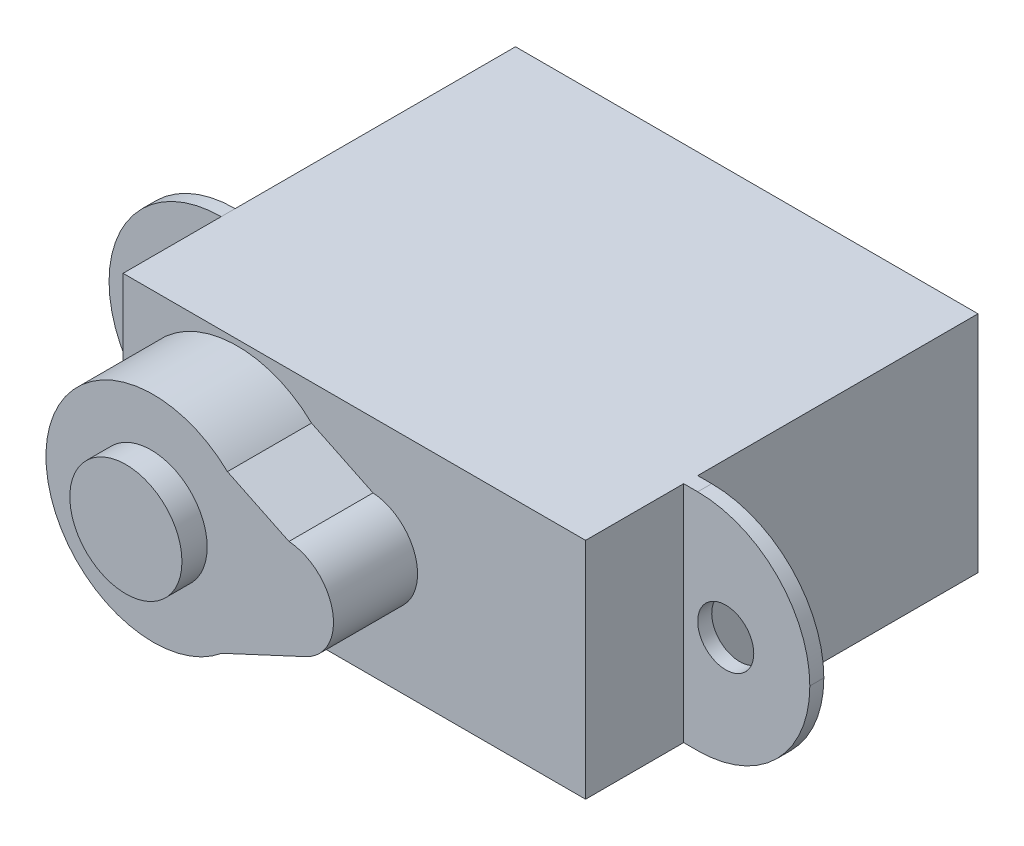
ISO-10303-21;
HEADER;
FILE_DESCRIPTION(('STEP AP214'),'2;1');
FILE_NAME('part.step','',(''),(''),'','','');
FILE_SCHEMA(('AUTOMOTIVE_DESIGN { 1 0 10303 214 1 1 1 1 }'));
ENDSEC;
DATA;
#1=APPLICATION_CONTEXT('core data for automotive mechanical design processes');
#2=APPLICATION_PROTOCOL_DEFINITION('international standard','automotive_design',2000,#1);
#3=PRODUCT_CONTEXT('',#1,'mechanical');
#4=PRODUCT('Part','Part','',(#3));
#5=PRODUCT_RELATED_PRODUCT_CATEGORY('part','',(#4));
#6=PRODUCT_DEFINITION_FORMATION('','',#4);
#7=PRODUCT_DEFINITION_CONTEXT('part definition',#1,'design');
#8=PRODUCT_DEFINITION('design','',#6,#7);
#9=PRODUCT_DEFINITION_SHAPE('','',#8);
#10=(LENGTH_UNIT() NAMED_UNIT(*) SI_UNIT(.MILLI.,.METRE.));
#11=(NAMED_UNIT(*) PLANE_ANGLE_UNIT() SI_UNIT($,.RADIAN.));
#12=(NAMED_UNIT(*) SI_UNIT($,.STERADIAN.) SOLID_ANGLE_UNIT());
#13=UNCERTAINTY_MEASURE_WITH_UNIT(LENGTH_MEASURE(1.E-05),#10,'distance_accuracy_value','');
#14=(GEOMETRIC_REPRESENTATION_CONTEXT(3) GLOBAL_UNCERTAINTY_ASSIGNED_CONTEXT((#13)) GLOBAL_UNIT_ASSIGNED_CONTEXT((#10,
#11,#12)) REPRESENTATION_CONTEXT('',''));
#15=CARTESIAN_POINT('',(0.,0.,0.));
#16=DIRECTION('',(0.,0.,1.));
#17=DIRECTION('',(1.,0.,0.));
#18=AXIS2_PLACEMENT_3D('',#15,#16,#17);
#19=CARTESIAN_POINT('',(-2.61728395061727,1.32778863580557,20.));
#20=DIRECTION('',(0.,0.,-1.));
#21=DIRECTION('',(-1.,0.,0.));
#22=AXIS2_PLACEMENT_3D('',#19,#20,#21);
#23=CYLINDRICAL_SURFACE('',#22,2.);
#24=CARTESIAN_POINT('',(-2.61728395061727,1.32778863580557,17.));
#25=DIRECTION('',(0.,0.,1.));
#26=DIRECTION('',(1.,0.,0.));
#27=AXIS2_PLACEMENT_3D('',#24,#25,#26);
#28=CIRCLE('',#27,2.);
#29=CARTESIAN_POINT('',(-0.61728395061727,1.32778863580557,17.));
#30=VERTEX_POINT('',#29);
#31=EDGE_CURVE('E232',#30,#30,#28,.T.);
#32=ORIENTED_EDGE('',*,*,#31,.T.);
#33=EDGE_LOOP('',(#32));
#34=FACE_BOUND('',#33,.T.);
#35=CARTESIAN_POINT('',(-2.61728395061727,1.32778863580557,17.9));
#36=DIRECTION('',(0.,0.,1.));
#37=DIRECTION('',(1.,0.,0.));
#38=AXIS2_PLACEMENT_3D('',#35,#36,#37);
#39=CIRCLE('',#38,2.);
#40=CARTESIAN_POINT('',(-0.61728395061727,1.32778863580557,17.9));
#41=VERTEX_POINT('',#40);
#42=EDGE_CURVE('E13',#41,#41,#39,.T.);
#43=ORIENTED_EDGE('',*,*,#42,.F.);
#44=EDGE_LOOP('',(#43));
#45=FACE_BOUND('',#44,.T.);
#46=ADVANCED_FACE('F46',(#34,#45),#23,.T.);
#47=CARTESIAN_POINT('',(-6.61728395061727,5.28395061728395,14.));
#48=DIRECTION('',(1.,0.,0.));
#49=DIRECTION('',(0.,0.,-1.));
#50=AXIS2_PLACEMENT_3D('',#47,#48,#49);
#51=PLANE('',#50);
#52=DIRECTION('',(0.,0.,-1.));
#53=VECTOR('',#52,1.);
#54=CARTESIAN_POINT('',(-6.61728395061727,5.28395061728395,14.));
#55=LINE('',#54,#53);
#56=CARTESIAN_POINT('',(-6.61728395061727,5.28395061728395,14.));
#57=VERTEX_POINT('',#56);
#58=CARTESIAN_POINT('',(-6.61728395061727,5.28395061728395,10.5));
#59=VERTEX_POINT('',#58);
#60=EDGE_CURVE('E229',#57,#59,#55,.T.);
#61=ORIENTED_EDGE('',*,*,#60,.T.);
#62=DIRECTION('',(0.,-1.,0.));
#63=VECTOR('',#62,1.);
#64=CARTESIAN_POINT('',(-6.61728395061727,5.28395061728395,10.5));
#65=LINE('',#64,#63);
#66=CARTESIAN_POINT('',(-6.61728395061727,-2.71604938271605,10.5));
#67=VERTEX_POINT('',#66);
#68=EDGE_CURVE('E223',#59,#67,#65,.T.);
#69=ORIENTED_EDGE('',*,*,#68,.T.);
#70=DIRECTION('',(0.,0.,-1.));
#71=VECTOR('',#70,1.);
#72=CARTESIAN_POINT('',(-6.61728395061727,-2.71604938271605,14.));
#73=LINE('',#72,#71);
#74=CARTESIAN_POINT('',(-6.61728395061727,-2.71604938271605,14.));
#75=VERTEX_POINT('',#74);
#76=EDGE_CURVE('E172',#75,#67,#73,.T.);
#77=ORIENTED_EDGE('',*,*,#76,.F.);
#78=DIRECTION('',(0.,-1.,0.));
#79=VECTOR('',#78,1.);
#80=CARTESIAN_POINT('',(-6.61728395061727,5.28395061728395,14.));
#81=LINE('',#80,#79);
#82=EDGE_CURVE('E227',#57,#75,#81,.T.);
#83=ORIENTED_EDGE('',*,*,#82,.F.);
#84=EDGE_LOOP('',(#61,#69,#77,#83));
#85=FACE_BOUND('',#84,.T.);
#86=ADVANCED_FACE('F346',(#85),#51,.F.);
#87=CARTESIAN_POINT('',(9.88271604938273,5.28395061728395,14.));
#88=DIRECTION('',(-1.,0.,0.));
#89=DIRECTION('',(0.,0.,1.));
#90=AXIS2_PLACEMENT_3D('',#87,#88,#89);
#91=PLANE('',#90);
#92=DIRECTION('',(0.,0.,-1.));
#93=VECTOR('',#92,1.);
#94=CARTESIAN_POINT('',(9.88271604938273,-2.71604938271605,14.));
#95=LINE('',#94,#93);
#96=CARTESIAN_POINT('',(9.88271604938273,-2.71604938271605,14.));
#97=VERTEX_POINT('',#96);
#98=CARTESIAN_POINT('',(9.88271604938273,-2.71604938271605,10.5));
#99=VERTEX_POINT('',#98);
#100=EDGE_CURVE('E220',#97,#99,#95,.T.);
#101=ORIENTED_EDGE('',*,*,#100,.T.);
#102=DIRECTION('',(0.,1.,0.));
#103=VECTOR('',#102,1.);
#104=CARTESIAN_POINT('',(9.88271604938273,5.28395061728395,10.5));
#105=LINE('',#104,#103);
#106=CARTESIAN_POINT('',(9.88271604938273,5.28395061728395,10.5));
#107=VERTEX_POINT('',#106);
#108=EDGE_CURVE('E187',#99,#107,#105,.T.);
#109=ORIENTED_EDGE('',*,*,#108,.T.);
#110=DIRECTION('',(0.,0.,-1.));
#111=VECTOR('',#110,1.);
#112=CARTESIAN_POINT('',(9.88271604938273,5.28395061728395,14.));
#113=LINE('',#112,#111);
#114=CARTESIAN_POINT('',(9.88271604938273,5.28395061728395,14.));
#115=VERTEX_POINT('',#114);
#116=EDGE_CURVE('E217',#115,#107,#113,.T.);
#117=ORIENTED_EDGE('',*,*,#116,.F.);
#118=DIRECTION('',(0.,1.,0.));
#119=VECTOR('',#118,1.);
#120=CARTESIAN_POINT('',(9.88271604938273,5.28395061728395,14.));
#121=LINE('',#120,#119);
#122=EDGE_CURVE('E243',#97,#115,#121,.T.);
#123=ORIENTED_EDGE('',*,*,#122,.F.);
#124=EDGE_LOOP('',(#101,#109,#117,#123));
#125=FACE_BOUND('',#124,.T.);
#126=ADVANCED_FACE('F339',(#125),#91,.F.);
#127=CARTESIAN_POINT('',(-6.61728395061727,-2.71604938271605,10.));
#128=VERTEX_POINT('',#127);
#129=CARTESIAN_POINT('',(-6.61728395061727,-2.71604938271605,0.));
#130=VERTEX_POINT('',#129);
#131=EDGE_CURVE('E169',#128,#130,#73,.T.);
#132=ORIENTED_EDGE('',*,*,#131,.F.);
#133=DIRECTION('',(0.,1.,0.));
#134=VECTOR('',#133,1.);
#135=CARTESIAN_POINT('',(-6.61728395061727,5.28395061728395,10.));
#136=LINE('',#135,#134);
#137=CARTESIAN_POINT('',(-6.61728395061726,5.28395061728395,10.));
#138=VERTEX_POINT('',#137);
#139=EDGE_CURVE('E180',#128,#138,#136,.T.);
#140=ORIENTED_EDGE('',*,*,#139,.T.);
#141=CARTESIAN_POINT('',(-6.61728395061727,5.28395061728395,0.));
#142=VERTEX_POINT('',#141);
#143=EDGE_CURVE('E186',#138,#142,#55,.T.);
#144=ORIENTED_EDGE('',*,*,#143,.T.);
#145=DIRECTION('',(0.,-1.,0.));
#146=VECTOR('',#145,1.);
#147=CARTESIAN_POINT('',(-6.61728395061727,5.28395061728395,0.));
#148=LINE('',#147,#146);
#149=EDGE_CURVE('E182',#142,#130,#148,.T.);
#150=ORIENTED_EDGE('',*,*,#149,.T.);
#151=EDGE_LOOP('',(#132,#140,#144,#150));
#152=FACE_BOUND('',#151,.T.);
#153=ADVANCED_FACE('F179',(#152),#51,.F.);
#154=CARTESIAN_POINT('',(-6.61728395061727,-2.71604938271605,14.));
#155=DIRECTION('',(0.,1.,0.));
#156=DIRECTION('',(0.,0.,1.));
#157=AXIS2_PLACEMENT_3D('',#154,#155,#156);
#158=PLANE('',#157);
#159=DIRECTION('',(-1.,0.,0.));
#160=VECTOR('',#159,1.);
#161=CARTESIAN_POINT('',(14.3827160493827,-2.71604938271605,10.));
#162=LINE('',#161,#160);
#163=CARTESIAN_POINT('',(10.3827160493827,-2.71604938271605,10.));
#164=VERTEX_POINT('',#163);
#165=CARTESIAN_POINT('',(9.88271604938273,-2.71604938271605,10.));
#166=VERTEX_POINT('',#165);
#167=EDGE_CURVE('E205',#164,#166,#162,.T.);
#168=ORIENTED_EDGE('',*,*,#167,.F.);
#169=DIRECTION('',(0.,0.,1.));
#170=VECTOR('',#169,1.);
#171=CARTESIAN_POINT('',(10.3827160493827,-2.71604938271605,10.5));
#172=LINE('',#171,#170);
#173=CARTESIAN_POINT('',(10.3827160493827,-2.71604938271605,10.5));
#174=VERTEX_POINT('',#173);
#175=EDGE_CURVE('E197',#164,#174,#172,.T.);
#176=ORIENTED_EDGE('',*,*,#175,.T.);
#177=DIRECTION('',(-1.,0.,0.));
#178=VECTOR('',#177,1.);
#179=CARTESIAN_POINT('',(14.3827160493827,-2.71604938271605,10.5));
#180=LINE('',#179,#178);
#181=EDGE_CURVE('E198',#174,#99,#180,.T.);
#182=ORIENTED_EDGE('',*,*,#181,.T.);
#183=ORIENTED_EDGE('',*,*,#100,.F.);
#184=DIRECTION('',(1.,0.,0.));
#185=VECTOR('',#184,1.);
#186=CARTESIAN_POINT('',(-6.61728395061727,-2.71604938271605,14.));
#187=LINE('',#186,#185);
#188=EDGE_CURVE('E245',#75,#97,#187,.T.);
#189=ORIENTED_EDGE('',*,*,#188,.F.);
#190=ORIENTED_EDGE('',*,*,#76,.T.);
#191=DIRECTION('',(0.,0.,1.));
#192=VECTOR('',#191,1.);
#193=CARTESIAN_POINT('',(-6.61728395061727,-2.71604938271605,14.));
#194=LINE('',#193,#192);
#195=EDGE_CURVE('E164',#67,#128,#194,.F.);
#196=ORIENTED_EDGE('',*,*,#195,.T.);
#197=ORIENTED_EDGE('',*,*,#131,.T.);
#198=DIRECTION('',(1.,0.,0.));
#199=VECTOR('',#198,1.);
#200=CARTESIAN_POINT('',(-6.61728395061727,-2.71604938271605,0.));
#201=LINE('',#200,#199);
#202=CARTESIAN_POINT('',(9.88271604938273,-2.71604938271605,0.));
#203=VERTEX_POINT('',#202);
#204=EDGE_CURVE('E183',#130,#203,#201,.T.);
#205=ORIENTED_EDGE('',*,*,#204,.T.);
#206=EDGE_CURVE('E224',#166,#203,#95,.T.);
#207=ORIENTED_EDGE('',*,*,#206,.F.);
#208=EDGE_LOOP('',(#168,#176,#182,#183,#189,#190,#196,#197,#205,#207));
#209=FACE_BOUND('',#208,.T.);
#210=ADVANCED_FACE('F167',(#209),#158,.F.);
#211=CARTESIAN_POINT('',(9.88271604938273,5.28395061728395,10.));
#212=VERTEX_POINT('',#211);
#213=CARTESIAN_POINT('',(9.88271604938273,5.28395061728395,0.));
#214=VERTEX_POINT('',#213);
#215=EDGE_CURVE('E228',#212,#214,#113,.T.);
#216=ORIENTED_EDGE('',*,*,#215,.F.);
#217=DIRECTION('',(0.,-1.,0.));
#218=VECTOR('',#217,1.);
#219=CARTESIAN_POINT('',(9.88271604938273,5.28395061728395,10.));
#220=LINE('',#219,#218);
#221=EDGE_CURVE('E238',#212,#166,#220,.T.);
#222=ORIENTED_EDGE('',*,*,#221,.T.);
#223=ORIENTED_EDGE('',*,*,#206,.T.);
#224=DIRECTION('',(0.,1.,0.));
#225=VECTOR('',#224,1.);
#226=CARTESIAN_POINT('',(9.88271604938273,5.28395061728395,0.));
#227=LINE('',#226,#225);
#228=EDGE_CURVE('E215',#203,#214,#227,.T.);
#229=ORIENTED_EDGE('',*,*,#228,.T.);
#230=EDGE_LOOP('',(#216,#222,#223,#229));
#231=FACE_BOUND('',#230,.T.);
#232=ADVANCED_FACE('F330',(#231),#91,.F.);
#233=CARTESIAN_POINT('',(-6.61728395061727,5.28395061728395,14.));
#234=DIRECTION('',(0.,-1.,0.));
#235=DIRECTION('',(0.,0.,-1.));
#236=AXIS2_PLACEMENT_3D('',#233,#234,#235);
#237=PLANE('',#236);
#238=DIRECTION('',(-1.,0.,0.));
#239=VECTOR('',#238,1.);
#240=CARTESIAN_POINT('',(14.3827160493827,5.28395061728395,10.5));
#241=LINE('',#240,#239);
#242=CARTESIAN_POINT('',(10.3827160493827,5.28395061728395,10.5));
#243=VERTEX_POINT('',#242);
#244=EDGE_CURVE('E202',#243,#107,#241,.T.);
#245=ORIENTED_EDGE('',*,*,#244,.F.);
#246=DIRECTION('',(0.,0.,-1.));
#247=VECTOR('',#246,1.);
#248=CARTESIAN_POINT('',(10.3827160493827,5.28395061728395,10.));
#249=LINE('',#248,#247);
#250=CARTESIAN_POINT('',(10.3827160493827,5.28395061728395,10.));
#251=VERTEX_POINT('',#250);
#252=EDGE_CURVE('E211',#243,#251,#249,.T.);
#253=ORIENTED_EDGE('',*,*,#252,.T.);
#254=DIRECTION('',(-1.,0.,0.));
#255=VECTOR('',#254,1.);
#256=CARTESIAN_POINT('',(14.3827160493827,5.28395061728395,10.));
#257=LINE('',#256,#255);
#258=EDGE_CURVE('E214',#251,#212,#257,.T.);
#259=ORIENTED_EDGE('',*,*,#258,.T.);
#260=ORIENTED_EDGE('',*,*,#215,.T.);
#261=DIRECTION('',(-1.,0.,0.));
#262=VECTOR('',#261,1.);
#263=CARTESIAN_POINT('',(-6.61728395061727,5.28395061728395,0.));
#264=LINE('',#263,#262);
#265=EDGE_CURVE('E218',#214,#142,#264,.T.);
#266=ORIENTED_EDGE('',*,*,#265,.T.);
#267=ORIENTED_EDGE('',*,*,#143,.F.);
#268=DIRECTION('',(0.,0.,-1.));
#269=VECTOR('',#268,1.);
#270=CARTESIAN_POINT('',(-6.61728395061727,5.28395061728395,14.));
#271=LINE('',#270,#269);
#272=EDGE_CURVE('E216',#138,#59,#271,.F.);
#273=ORIENTED_EDGE('',*,*,#272,.T.);
#274=ORIENTED_EDGE('',*,*,#60,.F.);
#275=DIRECTION('',(-1.,0.,0.));
#276=VECTOR('',#275,1.);
#277=CARTESIAN_POINT('',(-6.61728395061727,5.28395061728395,14.));
#278=LINE('',#277,#276);
#279=EDGE_CURVE('E240',#115,#57,#278,.T.);
#280=ORIENTED_EDGE('',*,*,#279,.F.);
#281=ORIENTED_EDGE('',*,*,#116,.T.);
#282=EDGE_LOOP('',(#245,#253,#259,#260,#266,#267,#273,#274,#280,#281));
#283=FACE_BOUND('',#282,.T.);
#284=ADVANCED_FACE('F324',(#283),#237,.F.);
#285=CARTESIAN_POINT('',(0.,0.,14.));
#286=DIRECTION('',(0.,0.,1.));
#287=DIRECTION('',(1.,0.,0.));
#288=AXIS2_PLACEMENT_3D('',#285,#286,#287);
#289=PLANE('',#288);
#290=CARTESIAN_POINT('',(-2.54066331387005,1.25043792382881,14.));
#291=DIRECTION('',(0.,0.,1.));
#292=DIRECTION('',(1.,0.,0.));
#293=AXIS2_PLACEMENT_3D('',#290,#291,#292);
#294=CIRCLE('',#293,3.82870321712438);
#295=CARTESIAN_POINT('',(0.105430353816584,4.01759470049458,14.));
#296=VERTEX_POINT('',#295);
#297=CARTESIAN_POINT('',(-0.0946737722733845,-1.69508469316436,14.));
#298=VERTEX_POINT('',#297);
#299=EDGE_CURVE('E242',#296,#298,#294,.T.);
#300=ORIENTED_EDGE('',*,*,#299,.F.);
#301=DIRECTION('',(-0.900694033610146,0.434453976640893,0.));
#302=VECTOR('',#301,1.);
#303=CARTESIAN_POINT('',(0.105430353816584,4.01759470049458,14.));
#304=LINE('',#303,#302);
#305=CARTESIAN_POINT('',(2.30086226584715,2.95861785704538,14.));
#306=VERTEX_POINT('',#305);
#307=EDGE_CURVE('E257',#306,#296,#304,.T.);
#308=ORIENTED_EDGE('',*,*,#307,.F.);
#309=CARTESIAN_POINT('',(2.17630747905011,1.25043792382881,14.));
#310=DIRECTION('',(0.,0.,1.));
#311=DIRECTION('',(1.,0.,0.));
#312=AXIS2_PLACEMENT_3D('',#309,#310,#311);
#313=CIRCLE('',#312,1.71271497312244);
#314=CARTESIAN_POINT('',(2.89875783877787,-0.302449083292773,14.));
#315=VERTEX_POINT('',#314);
#316=EDGE_CURVE('E252',#315,#306,#313,.T.);
#317=ORIENTED_EDGE('',*,*,#316,.F.);
#318=DIRECTION('',(0.906681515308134,0.421815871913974,0.));
#319=VECTOR('',#318,1.);
#320=CARTESIAN_POINT('',(2.89875783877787,-0.302449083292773,14.));
#321=LINE('',#320,#319);
#322=EDGE_CURVE('E253',#298,#315,#321,.T.);
#323=ORIENTED_EDGE('',*,*,#322,.F.);
#324=EDGE_LOOP('',(#300,#308,#317,#323));
#325=FACE_BOUND('',#324,.T.);
#326=ORIENTED_EDGE('',*,*,#82,.T.);
#327=ORIENTED_EDGE('',*,*,#188,.T.);
#328=ORIENTED_EDGE('',*,*,#122,.T.);
#329=ORIENTED_EDGE('',*,*,#279,.T.);
#330=EDGE_LOOP('',(#326,#327,#328,#329));
#331=FACE_BOUND('',#330,.T.);
#332=ADVANCED_FACE('F342',(#325,#331),#289,.T.);
#333=CARTESIAN_POINT('',(0.,0.,0.));
#334=DIRECTION('',(0.,0.,1.));
#335=DIRECTION('',(1.,0.,0.));
#336=AXIS2_PLACEMENT_3D('',#333,#334,#335);
#337=PLANE('',#336);
#338=ORIENTED_EDGE('',*,*,#149,.F.);
#339=ORIENTED_EDGE('',*,*,#265,.F.);
#340=ORIENTED_EDGE('',*,*,#228,.F.);
#341=ORIENTED_EDGE('',*,*,#204,.F.);
#342=EDGE_LOOP('',(#338,#339,#340,#341));
#343=FACE_BOUND('',#342,.T.);
#344=ADVANCED_FACE('F334',(#343),#337,.F.);
#345=CARTESIAN_POINT('',(-2.54066331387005,1.25043792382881,17.));
#346=DIRECTION('',(0.,0.,-1.));
#347=DIRECTION('',(-1.,0.,0.));
#348=AXIS2_PLACEMENT_3D('',#345,#346,#347);
#349=CYLINDRICAL_SURFACE('',#348,3.82870321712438);
#350=ORIENTED_EDGE('',*,*,#299,.T.);
#351=DIRECTION('',(0.,0.,-1.));
#352=VECTOR('',#351,1.);
#353=CARTESIAN_POINT('',(-0.0946737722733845,-1.69508469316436,17.));
#354=LINE('',#353,#352);
#355=CARTESIAN_POINT('',(-0.0946737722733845,-1.69508469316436,17.));
#356=VERTEX_POINT('',#355);
#357=EDGE_CURVE('E249',#356,#298,#354,.T.);
#358=ORIENTED_EDGE('',*,*,#357,.F.);
#359=CARTESIAN_POINT('',(-2.54066331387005,1.25043792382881,17.));
#360=DIRECTION('',(0.,0.,1.));
#361=DIRECTION('',(1.,0.,0.));
#362=AXIS2_PLACEMENT_3D('',#359,#360,#361);
#363=CIRCLE('',#362,3.82870321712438);
#364=CARTESIAN_POINT('',(0.105430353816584,4.01759470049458,17.));
#365=VERTEX_POINT('',#364);
#366=EDGE_CURVE('E261',#365,#356,#363,.T.);
#367=ORIENTED_EDGE('',*,*,#366,.F.);
#368=DIRECTION('',(0.,0.,-1.));
#369=VECTOR('',#368,1.);
#370=CARTESIAN_POINT('',(0.105430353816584,4.01759470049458,17.));
#371=LINE('',#370,#369);
#372=EDGE_CURVE('E262',#365,#296,#371,.T.);
#373=ORIENTED_EDGE('',*,*,#372,.T.);
#374=EDGE_LOOP('',(#350,#358,#367,#373));
#375=FACE_BOUND('',#374,.T.);
#376=ADVANCED_FACE('F392',(#375),#349,.T.);
#377=CARTESIAN_POINT('',(2.89875783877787,-0.302449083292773,17.));
#378=DIRECTION('',(-0.421815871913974,0.906681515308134,0.));
#379=DIRECTION('',(-0.906681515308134,-0.421815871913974,0.));
#380=AXIS2_PLACEMENT_3D('',#377,#378,#379);
#381=PLANE('',#380);
#382=ORIENTED_EDGE('',*,*,#322,.T.);
#383=DIRECTION('',(0.,0.,-1.));
#384=VECTOR('',#383,1.);
#385=CARTESIAN_POINT('',(2.89875783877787,-0.302449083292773,17.));
#386=LINE('',#385,#384);
#387=CARTESIAN_POINT('',(2.89875783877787,-0.302449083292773,17.));
#388=VERTEX_POINT('',#387);
#389=EDGE_CURVE('E254',#388,#315,#386,.T.);
#390=ORIENTED_EDGE('',*,*,#389,.F.);
#391=DIRECTION('',(0.906681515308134,0.421815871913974,0.));
#392=VECTOR('',#391,1.);
#393=CARTESIAN_POINT('',(2.89875783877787,-0.302449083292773,17.));
#394=LINE('',#393,#392);
#395=EDGE_CURVE('E276',#356,#388,#394,.T.);
#396=ORIENTED_EDGE('',*,*,#395,.F.);
#397=ORIENTED_EDGE('',*,*,#357,.T.);
#398=EDGE_LOOP('',(#382,#390,#396,#397));
#399=FACE_BOUND('',#398,.T.);
#400=ADVANCED_FACE('F388',(#399),#381,.F.);
#401=CARTESIAN_POINT('',(2.17630747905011,1.25043792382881,17.));
#402=DIRECTION('',(0.,0.,-1.));
#403=DIRECTION('',(-1.,0.,0.));
#404=AXIS2_PLACEMENT_3D('',#401,#402,#403);
#405=CYLINDRICAL_SURFACE('',#404,1.71271497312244);
#406=ORIENTED_EDGE('',*,*,#316,.T.);
#407=DIRECTION('',(0.,0.,-1.));
#408=VECTOR('',#407,1.);
#409=CARTESIAN_POINT('',(2.30086226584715,2.95861785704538,17.));
#410=LINE('',#409,#408);
#411=CARTESIAN_POINT('',(2.30086226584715,2.95861785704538,17.));
#412=VERTEX_POINT('',#411);
#413=EDGE_CURVE('E258',#412,#306,#410,.T.);
#414=ORIENTED_EDGE('',*,*,#413,.F.);
#415=CARTESIAN_POINT('',(2.17630747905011,1.25043792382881,17.));
#416=DIRECTION('',(0.,0.,1.));
#417=DIRECTION('',(1.,0.,0.));
#418=AXIS2_PLACEMENT_3D('',#415,#416,#417);
#419=CIRCLE('',#418,1.71271497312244);
#420=EDGE_CURVE('E274',#388,#412,#419,.T.);
#421=ORIENTED_EDGE('',*,*,#420,.F.);
#422=ORIENTED_EDGE('',*,*,#389,.T.);
#423=EDGE_LOOP('',(#406,#414,#421,#422));
#424=FACE_BOUND('',#423,.T.);
#425=ADVANCED_FACE('F384',(#424),#405,.T.);
#426=CARTESIAN_POINT('',(0.105430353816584,4.01759470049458,17.));
#427=DIRECTION('',(-0.434453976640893,-0.900694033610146,0.));
#428=DIRECTION('',(0.900694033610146,-0.434453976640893,0.));
#429=AXIS2_PLACEMENT_3D('',#426,#427,#428);
#430=PLANE('',#429);
#431=ORIENTED_EDGE('',*,*,#307,.T.);
#432=ORIENTED_EDGE('',*,*,#372,.F.);
#433=DIRECTION('',(-0.900694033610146,0.434453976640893,0.));
#434=VECTOR('',#433,1.);
#435=CARTESIAN_POINT('',(0.105430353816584,4.01759470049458,17.));
#436=LINE('',#435,#434);
#437=EDGE_CURVE('E209',#412,#365,#436,.T.);
#438=ORIENTED_EDGE('',*,*,#437,.F.);
#439=ORIENTED_EDGE('',*,*,#413,.T.);
#440=EDGE_LOOP('',(#431,#432,#438,#439));
#441=FACE_BOUND('',#440,.T.);
#442=ADVANCED_FACE('F380',(#441),#430,.F.);
#443=CARTESIAN_POINT('',(-2.54066331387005,1.25043792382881,17.));
#444=DIRECTION('',(0.,0.,1.));
#445=DIRECTION('',(1.,0.,0.));
#446=AXIS2_PLACEMENT_3D('',#443,#444,#445);
#447=PLANE('',#446);
#448=ORIENTED_EDGE('',*,*,#31,.F.);
#449=EDGE_LOOP('',(#448));
#450=FACE_BOUND('',#449,.T.);
#451=ORIENTED_EDGE('',*,*,#366,.T.);
#452=ORIENTED_EDGE('',*,*,#395,.T.);
#453=ORIENTED_EDGE('',*,*,#420,.T.);
#454=ORIENTED_EDGE('',*,*,#437,.T.);
#455=EDGE_LOOP('',(#451,#452,#453,#454));
#456=FACE_BOUND('',#455,.T.);
#457=ADVANCED_FACE('F377',(#450,#456),#447,.T.);
#458=CARTESIAN_POINT('',(14.3827160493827,5.28395061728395,10.));
#459=DIRECTION('',(0.,0.,-1.));
#460=DIRECTION('',(0.,1.,0.));
#461=AXIS2_PLACEMENT_3D('',#458,#459,#460);
#462=PLANE('',#461);
#463=CARTESIAN_POINT('',(11.3827160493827,1.28395061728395,10.));
#464=DIRECTION('',(0.,0.,-1.));
#465=DIRECTION('',(0.,1.,0.));
#466=AXIS2_PLACEMENT_3D('',#463,#464,#465);
#467=CIRCLE('',#466,1.);
#468=CARTESIAN_POINT('',(11.3827160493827,2.28395061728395,10.));
#469=VERTEX_POINT('',#468);
#470=EDGE_CURVE('E294',#469,#469,#467,.T.);
#471=ORIENTED_EDGE('',*,*,#470,.F.);
#472=EDGE_LOOP('',(#471));
#473=FACE_BOUND('',#472,.T.);
#474=ORIENTED_EDGE('',*,*,#258,.F.);
#475=CARTESIAN_POINT('',(10.3827160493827,1.28395061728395,10.));
#476=DIRECTION('',(0.,0.,-1.));
#477=DIRECTION('',(0.,1.,0.));
#478=AXIS2_PLACEMENT_3D('',#475,#476,#477);
#479=CIRCLE('',#478,4.);
#480=CARTESIAN_POINT('',(14.3827160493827,1.28395061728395,10.));
#481=VERTEX_POINT('',#480);
#482=EDGE_CURVE('E206',#251,#481,#479,.T.);
#483=ORIENTED_EDGE('',*,*,#482,.T.);
#484=CARTESIAN_POINT('',(10.3827160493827,1.28395061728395,10.));
#485=DIRECTION('',(0.,0.,-1.));
#486=DIRECTION('',(0.,1.,0.));
#487=AXIS2_PLACEMENT_3D('',#484,#485,#486);
#488=CIRCLE('',#487,4.);
#489=EDGE_CURVE('E208',#481,#164,#488,.T.);
#490=ORIENTED_EDGE('',*,*,#489,.T.);
#491=ORIENTED_EDGE('',*,*,#167,.T.);
#492=ORIENTED_EDGE('',*,*,#221,.F.);
#493=EDGE_LOOP('',(#474,#483,#490,#491,#492));
#494=FACE_BOUND('',#493,.T.);
#495=ADVANCED_FACE('F305',(#473,#494),#462,.T.);
#496=CARTESIAN_POINT('',(14.3827160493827,5.28395061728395,10.5));
#497=DIRECTION('',(0.,0.,1.));
#498=DIRECTION('',(0.,-1.,0.));
#499=AXIS2_PLACEMENT_3D('',#496,#497,#498);
#500=PLANE('',#499);
#501=CARTESIAN_POINT('',(11.3827160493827,1.28395061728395,10.5));
#502=DIRECTION('',(0.,0.,1.));
#503=DIRECTION('',(1.,0.,0.));
#504=AXIS2_PLACEMENT_3D('',#501,#502,#503);
#505=CIRCLE('',#504,1.);
#506=CARTESIAN_POINT('',(12.3827160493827,1.28395061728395,10.5));
#507=VERTEX_POINT('',#506);
#508=EDGE_CURVE('E56',#507,#507,#505,.T.);
#509=ORIENTED_EDGE('',*,*,#508,.F.);
#510=EDGE_LOOP('',(#509));
#511=FACE_BOUND('',#510,.T.);
#512=CARTESIAN_POINT('',(10.3827160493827,1.28395061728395,10.5));
#513=DIRECTION('',(0.,0.,1.));
#514=DIRECTION('',(0.,-1.,0.));
#515=AXIS2_PLACEMENT_3D('',#512,#513,#514);
#516=CIRCLE('',#515,4.);
#517=CARTESIAN_POINT('',(14.3827160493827,1.28395061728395,10.5));
#518=VERTEX_POINT('',#517);
#519=EDGE_CURVE('E203',#174,#518,#516,.T.);
#520=ORIENTED_EDGE('',*,*,#519,.T.);
#521=CARTESIAN_POINT('',(10.3827160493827,1.28395061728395,10.5));
#522=DIRECTION('',(0.,0.,1.));
#523=DIRECTION('',(0.,-1.,0.));
#524=AXIS2_PLACEMENT_3D('',#521,#522,#523);
#525=CIRCLE('',#524,4.);
#526=EDGE_CURVE('E200',#518,#243,#525,.T.);
#527=ORIENTED_EDGE('',*,*,#526,.T.);
#528=ORIENTED_EDGE('',*,*,#244,.T.);
#529=ORIENTED_EDGE('',*,*,#108,.F.);
#530=ORIENTED_EDGE('',*,*,#181,.F.);
#531=EDGE_LOOP('',(#520,#527,#528,#529,#530));
#532=FACE_BOUND('',#531,.T.);
#533=ADVANCED_FACE('F301',(#511,#532),#500,.T.);
#534=CARTESIAN_POINT('',(-8.11728395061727,1.28395061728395,10.5));
#535=DIRECTION('',(0.,0.,1.));
#536=DIRECTION('',(1.,0.,0.));
#537=AXIS2_PLACEMENT_3D('',#534,#535,#536);
#538=CIRCLE('',#537,1.);
#539=CARTESIAN_POINT('',(-7.11728395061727,1.28395061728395,10.5));
#540=VERTEX_POINT('',#539);
#541=EDGE_CURVE('E50',#540,#540,#538,.T.);
#542=ORIENTED_EDGE('',*,*,#541,.F.);
#543=EDGE_LOOP('',(#542));
#544=FACE_BOUND('',#543,.T.);
#545=ORIENTED_EDGE('',*,*,#68,.F.);
#546=CARTESIAN_POINT('',(-6.61728395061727,1.28395061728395,10.5));
#547=DIRECTION('',(0.,0.,1.));
#548=DIRECTION('',(0.,-1.,0.));
#549=AXIS2_PLACEMENT_3D('',#546,#547,#548);
#550=CIRCLE('',#549,4.);
#551=CARTESIAN_POINT('',(-10.6172839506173,1.28395061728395,10.5));
#552=VERTEX_POINT('',#551);
#553=EDGE_CURVE('E65',#59,#552,#550,.T.);
#554=ORIENTED_EDGE('',*,*,#553,.T.);
#555=CARTESIAN_POINT('',(-6.61728395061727,1.28395061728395,10.5));
#556=DIRECTION('',(0.,0.,1.));
#557=DIRECTION('',(0.,-1.,0.));
#558=AXIS2_PLACEMENT_3D('',#555,#556,#557);
#559=CIRCLE('',#558,4.);
#560=EDGE_CURVE('E191',#552,#67,#559,.T.);
#561=ORIENTED_EDGE('',*,*,#560,.T.);
#562=EDGE_LOOP('',(#545,#554,#561));
#563=FACE_BOUND('',#562,.T.);
#564=ADVANCED_FACE('F304',(#544,#563),#500,.T.);
#565=CARTESIAN_POINT('',(-8.11728395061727,1.28395061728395,10.));
#566=DIRECTION('',(0.,0.,-1.));
#567=DIRECTION('',(0.,1.,0.));
#568=AXIS2_PLACEMENT_3D('',#565,#566,#567);
#569=CIRCLE('',#568,1.);
#570=CARTESIAN_POINT('',(-8.11728395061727,2.28395061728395,10.));
#571=VERTEX_POINT('',#570);
#572=EDGE_CURVE('E350',#571,#571,#569,.T.);
#573=ORIENTED_EDGE('',*,*,#572,.F.);
#574=EDGE_LOOP('',(#573));
#575=FACE_BOUND('',#574,.T.);
#576=CARTESIAN_POINT('',(-6.61728395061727,1.28395061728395,10.));
#577=DIRECTION('',(0.,0.,-1.));
#578=DIRECTION('',(0.,1.,0.));
#579=AXIS2_PLACEMENT_3D('',#576,#577,#578);
#580=CIRCLE('',#579,4.);
#581=CARTESIAN_POINT('',(-10.6172839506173,1.28395061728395,10.));
#582=VERTEX_POINT('',#581);
#583=EDGE_CURVE('E143',#128,#582,#580,.T.);
#584=ORIENTED_EDGE('',*,*,#583,.T.);
#585=CARTESIAN_POINT('',(-6.61728395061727,1.28395061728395,10.));
#586=DIRECTION('',(0.,0.,-1.));
#587=DIRECTION('',(0.,1.,0.));
#588=AXIS2_PLACEMENT_3D('',#585,#586,#587);
#589=CIRCLE('',#588,4.);
#590=EDGE_CURVE('E138',#582,#138,#589,.T.);
#591=ORIENTED_EDGE('',*,*,#590,.T.);
#592=ORIENTED_EDGE('',*,*,#139,.F.);
#593=EDGE_LOOP('',(#584,#591,#592));
#594=FACE_BOUND('',#593,.T.);
#595=ADVANCED_FACE('F185',(#575,#594),#462,.T.);
#596=CARTESIAN_POINT('',(10.3827160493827,1.28395061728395,14.));
#597=DIRECTION('',(0.,0.,-1.));
#598=DIRECTION('',(-1.,0.,0.));
#599=AXIS2_PLACEMENT_3D('',#596,#597,#598);
#600=CYLINDRICAL_SURFACE('',#599,4.);
#601=DIRECTION('',(0.,0.,1.));
#602=VECTOR('',#601,1.);
#603=CARTESIAN_POINT('',(14.3827160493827,1.28395061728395,10.));
#604=LINE('',#603,#602);
#605=EDGE_CURVE('E193',#518,#481,#604,.F.);
#606=ORIENTED_EDGE('',*,*,#605,.F.);
#607=ORIENTED_EDGE('',*,*,#519,.F.);
#608=ORIENTED_EDGE('',*,*,#175,.F.);
#609=ORIENTED_EDGE('',*,*,#489,.F.);
#610=EDGE_LOOP('',(#606,#607,#608,#609));
#611=FACE_BOUND('',#610,.T.);
#612=ADVANCED_FACE('F317',(#611),#600,.T.);
#613=CARTESIAN_POINT('',(10.3827160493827,1.28395061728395,14.));
#614=DIRECTION('',(0.,0.,1.));
#615=DIRECTION('',(1.,0.,0.));
#616=AXIS2_PLACEMENT_3D('',#613,#614,#615);
#617=CYLINDRICAL_SURFACE('',#616,4.);
#618=ORIENTED_EDGE('',*,*,#526,.F.);
#619=ORIENTED_EDGE('',*,*,#605,.T.);
#620=ORIENTED_EDGE('',*,*,#482,.F.);
#621=ORIENTED_EDGE('',*,*,#252,.F.);
#622=EDGE_LOOP('',(#618,#619,#620,#621));
#623=FACE_BOUND('',#622,.T.);
#624=ADVANCED_FACE('F321',(#623),#617,.T.);
#625=CARTESIAN_POINT('',(-6.61728395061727,1.28395061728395,0.));
#626=DIRECTION('',(0.,0.,1.));
#627=DIRECTION('',(1.,0.,0.));
#628=AXIS2_PLACEMENT_3D('',#625,#626,#627);
#629=CYLINDRICAL_SURFACE('',#628,4.);
#630=ORIENTED_EDGE('',*,*,#195,.F.);
#631=ORIENTED_EDGE('',*,*,#560,.F.);
#632=DIRECTION('',(0.,0.,1.));
#633=VECTOR('',#632,1.);
#634=CARTESIAN_POINT('',(-10.6172839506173,1.28395061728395,0.));
#635=LINE('',#634,#633);
#636=EDGE_CURVE('E190',#582,#552,#635,.T.);
#637=ORIENTED_EDGE('',*,*,#636,.F.);
#638=ORIENTED_EDGE('',*,*,#583,.F.);
#639=EDGE_LOOP('',(#630,#631,#637,#638));
#640=FACE_BOUND('',#639,.T.);
#641=ADVANCED_FACE('F189',(#640),#629,.T.);
#642=CARTESIAN_POINT('',(-6.61728395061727,1.28395061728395,0.));
#643=DIRECTION('',(0.,0.,-1.));
#644=DIRECTION('',(-1.,0.,0.));
#645=AXIS2_PLACEMENT_3D('',#642,#643,#644);
#646=CYLINDRICAL_SURFACE('',#645,4.);
#647=ORIENTED_EDGE('',*,*,#553,.F.);
#648=ORIENTED_EDGE('',*,*,#272,.F.);
#649=ORIENTED_EDGE('',*,*,#590,.F.);
#650=ORIENTED_EDGE('',*,*,#636,.T.);
#651=EDGE_LOOP('',(#647,#648,#649,#650));
#652=FACE_BOUND('',#651,.T.);
#653=ADVANCED_FACE('F349',(#652),#646,.T.);
#654=CARTESIAN_POINT('',(-8.11728395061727,1.28395061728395,6.5));
#655=DIRECTION('',(0.,0.,1.));
#656=DIRECTION('',(1.,0.,0.));
#657=AXIS2_PLACEMENT_3D('',#654,#655,#656);
#658=CYLINDRICAL_SURFACE('',#657,1.);
#659=ORIENTED_EDGE('',*,*,#572,.T.);
#660=EDGE_LOOP('',(#659));
#661=FACE_BOUND('',#660,.T.);
#662=ORIENTED_EDGE('',*,*,#541,.T.);
#663=EDGE_LOOP('',(#662));
#664=FACE_BOUND('',#663,.T.);
#665=ADVANCED_FACE('F360',(#661,#664),#658,.F.);
#666=CARTESIAN_POINT('',(11.3827160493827,1.28395061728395,6.5));
#667=DIRECTION('',(0.,0.,1.));
#668=DIRECTION('',(1.,0.,0.));
#669=AXIS2_PLACEMENT_3D('',#666,#667,#668);
#670=CYLINDRICAL_SURFACE('',#669,1.);
#671=ORIENTED_EDGE('',*,*,#470,.T.);
#672=EDGE_LOOP('',(#671));
#673=FACE_BOUND('',#672,.T.);
#674=ORIENTED_EDGE('',*,*,#508,.T.);
#675=EDGE_LOOP('',(#674));
#676=FACE_BOUND('',#675,.T.);
#677=ADVANCED_FACE('F299',(#673,#676),#670,.F.);
#678=CARTESIAN_POINT('',(13.1747761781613,5.28395061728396,17.9));
#679=DIRECTION('',(0.,0.,1.));
#680=DIRECTION('',(1.,0.,0.));
#681=AXIS2_PLACEMENT_3D('',#678,#679,#680);
#682=PLANE('',#681);
#683=ORIENTED_EDGE('',*,*,#42,.T.);
#684=EDGE_LOOP('',(#683));
#685=FACE_BOUND('',#684,.T.);
#686=ADVANCED_FACE('F48',(#685),#682,.T.);
#687=CLOSED_SHELL('',(#46,#86,#126,#153,#210,#232,#284,#332,#344,#376,#400,#425,#442,#457,#495,
#533,#564,#595,#612,#624,#641,#653,#665,#677,#686));
#688=MANIFOLD_SOLID_BREP('B2',#687);
#689=ADVANCED_BREP_SHAPE_REPRESENTATION('',(#18,#688),#14);
#690=SHAPE_DEFINITION_REPRESENTATION(#9,#689);
ENDSEC;
END-ISO-10303-21;
